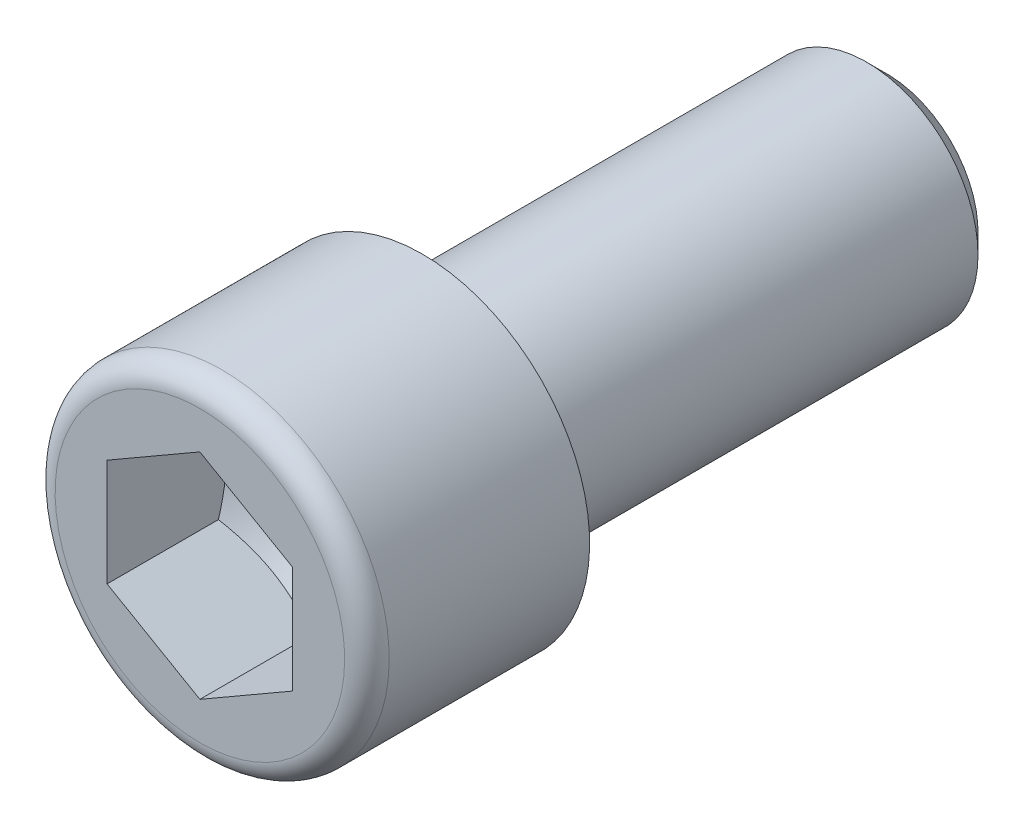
ISO-10303-21;
HEADER;
FILE_DESCRIPTION(('STEP AP214'),'2;1');
FILE_NAME('part.step','',(''),(''),'','','');
FILE_SCHEMA(('AUTOMOTIVE_DESIGN { 1 0 10303 214 1 1 1 1 }'));
ENDSEC;
DATA;
#1=APPLICATION_CONTEXT('core data for automotive mechanical design processes');
#2=APPLICATION_PROTOCOL_DEFINITION('international standard','automotive_design',2000,#1);
#3=PRODUCT_CONTEXT('',#1,'mechanical');
#4=PRODUCT('Part','Part','',(#3));
#5=PRODUCT_RELATED_PRODUCT_CATEGORY('part','',(#4));
#6=PRODUCT_DEFINITION_FORMATION('','',#4);
#7=PRODUCT_DEFINITION_CONTEXT('part definition',#1,'design');
#8=PRODUCT_DEFINITION('design','',#6,#7);
#9=PRODUCT_DEFINITION_SHAPE('','',#8);
#10=(LENGTH_UNIT() NAMED_UNIT(*) SI_UNIT(.MILLI.,.METRE.));
#11=(NAMED_UNIT(*) PLANE_ANGLE_UNIT() SI_UNIT($,.RADIAN.));
#12=(NAMED_UNIT(*) SI_UNIT($,.STERADIAN.) SOLID_ANGLE_UNIT());
#13=UNCERTAINTY_MEASURE_WITH_UNIT(LENGTH_MEASURE(1.E-05),#10,'distance_accuracy_value','');
#14=(GEOMETRIC_REPRESENTATION_CONTEXT(3) GLOBAL_UNCERTAINTY_ASSIGNED_CONTEXT((#13)) GLOBAL_UNIT_ASSIGNED_CONTEXT((#10,
#11,#12)) REPRESENTATION_CONTEXT('',''));
#15=CARTESIAN_POINT('',(0.,0.,0.));
#16=DIRECTION('',(0.,0.,1.));
#17=DIRECTION('',(1.,0.,0.));
#18=AXIS2_PLACEMENT_3D('',#15,#16,#17);
#19=CARTESIAN_POINT('',(-9.52916410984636E-12,-5.49977766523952E-12,6.01999999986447));
#20=DIRECTION('',(-1.58298229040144E-12,-9.13546995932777E-13,1.));
#21=DIRECTION('',(0.866025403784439,-0.5,9.14129379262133E-13));
#22=AXIS2_PLACEMENT_3D('',#19,#20,#21);
#23=CONICAL_SURFACE('',#22,5.80814370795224,1.04719755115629);
#24=CARTESIAN_POINT('',(-6.10645325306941E-11,-1.00891914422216E-10,2.66666666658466));
#25=VERTEX_POINT('',#24);
#26=VERTEX_LOOP('',#25);
#27=FACE_BOUND('',#26,.T.);
#28=CARTESIAN_POINT('',(4.99999999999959,2.88675134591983,5.99999999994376));
#29=CARTESIAN_POINT('',(4.78026878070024,3.01361322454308,5.92674338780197));
#30=CARTESIAN_POINT('',(4.55865818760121,3.14156016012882,5.86011395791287));
#31=CARTESIAN_POINT('',(4.1115999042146,3.39966938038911,5.74381369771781));
#32=CARTESIAN_POINT('',(3.88614427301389,3.529836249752,5.69418400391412));
#33=CARTESIAN_POINT('',(3.43799264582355,3.78857671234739,5.6169443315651));
#34=CARTESIAN_POINT('',(3.21536642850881,3.91711001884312,5.58881982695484));
#35=CARTESIAN_POINT('',(2.88064429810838,4.1103619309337,5.56360327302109));
#36=CARTESIAN_POINT('',(2.76899393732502,4.17482329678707,5.55802472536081));
#37=CARTESIAN_POINT('',(2.54559014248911,4.30380553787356,5.55261913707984));
#38=CARTESIAN_POINT('',(2.4338367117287,4.36832641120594,5.55279191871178));
#39=CARTESIAN_POINT('',(2.12768962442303,4.54508051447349,5.56117973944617));
#40=CARTESIAN_POINT('',(1.93339749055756,4.65725513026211,5.57525699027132));
#41=CARTESIAN_POINT('',(1.54610267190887,4.8808598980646,5.6198894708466));
#42=CARTESIAN_POINT('',(1.35310134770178,4.99228926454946,5.65045994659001));
#43=CARTESIAN_POINT('',(0.965026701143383,5.21634426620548,5.72687569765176));
#44=CARTESIAN_POINT('',(0.770002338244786,5.32894163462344,5.77304466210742));
#45=CARTESIAN_POINT('',(0.382861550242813,5.55245747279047,5.8778288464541));
#46=CARTESIAN_POINT('',(0.190740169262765,5.66337880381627,5.93641946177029));
#47=CARTESIAN_POINT('',(-2.6400756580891E-11,5.77350269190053,5.99999999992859));
#48=B_SPLINE_CURVE_WITH_KNOTS('',3,(#28,#29,#30,#31,#32,#33,#34,#35,#36,#37,#38,#39,#40,#41,#42,
#43,#44,#45,#46,#47),.UNSPECIFIED.,.F.,.F.,(4,2,2,2,2,2,2,2,2,4),(0.,0.792540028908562,
1.58698454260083,2.36176901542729,2.7487873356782,3.13579369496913,3.80946092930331,
4.48375195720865,5.17299552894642,5.86088640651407),.UNSPECIFIED.);
#49=CARTESIAN_POINT('',(5.,2.88675134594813,5.99999999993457));
#50=VERTEX_POINT('',#49);
#51=CARTESIAN_POINT('',(-1.8996956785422E-11,5.77350269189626,5.99999999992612));
#52=VERTEX_POINT('',#51);
#53=EDGE_CURVE('E18',#50,#52,#48,.T.);
#54=ORIENTED_EDGE('',*,*,#53,.T.);
#55=CARTESIAN_POINT('',(1.48067322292E-11,5.77350269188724,5.99999999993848));
#56=CARTESIAN_POINT('',(-0.219731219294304,5.64664081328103,5.92674338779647));
#57=CARTESIAN_POINT('',(-0.441341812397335,5.51869387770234,5.86011395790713));
#58=CARTESIAN_POINT('',(-0.888400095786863,5.26058465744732,5.7438136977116));
#59=CARTESIAN_POINT('',(-1.11385572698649,5.13041778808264,5.69418400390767));
#60=CARTESIAN_POINT('',(-1.56200735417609,4.8716773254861,5.61694433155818));
#61=CARTESIAN_POINT('',(-1.78463357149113,4.74314401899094,5.58881982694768));
#62=CARTESIAN_POINT('',(-2.11935570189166,4.54989210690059,5.56360327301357));
#63=CARTESIAN_POINT('',(-2.23100606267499,4.48543074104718,5.55802472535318));
#64=CARTESIAN_POINT('',(-2.45440985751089,4.35644849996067,5.55261913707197));
#65=CARTESIAN_POINT('',(-2.5661632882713,4.29192762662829,5.5527919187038));
#66=CARTESIAN_POINT('',(-2.87231037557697,4.11517352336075,5.56117973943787));
#67=CARTESIAN_POINT('',(-3.06660250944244,4.00299890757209,5.57525699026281));
#68=CARTESIAN_POINT('',(-3.45389732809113,3.77939413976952,5.61988947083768));
#69=CARTESIAN_POINT('',(-3.64689865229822,3.6679647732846,5.65045994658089));
#70=CARTESIAN_POINT('',(-4.03497329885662,3.44390977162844,5.72687569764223));
#71=CARTESIAN_POINT('',(-4.22999766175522,3.3313124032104,5.77304466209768));
#72=CARTESIAN_POINT('',(-4.61713844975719,3.10779656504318,5.87782884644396));
#73=CARTESIAN_POINT('',(-4.80925983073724,2.99687523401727,5.93641946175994));
#74=CARTESIAN_POINT('',(-5.0000000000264,2.88675134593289,5.99999999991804));
#75=B_SPLINE_CURVE_WITH_KNOTS('',3,(#55,#56,#57,#58,#59,#60,#61,#62,#63,#64,#65,#66,#67,#68,#69,
#70,#71,#72,#73,#74),.UNSPECIFIED.,.F.,.F.,(4,2,2,2,2,2,2,2,2,4),(0.,0.792540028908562,
1.58698454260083,2.36176901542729,2.74878733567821,3.13579369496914,3.80946092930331,
4.48375195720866,5.17299552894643,5.86088640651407),.UNSPECIFIED.);
#76=CARTESIAN_POINT('',(-5.000000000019,2.88675134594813,5.99999999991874));
#77=VERTEX_POINT('',#76);
#78=EDGE_CURVE('E79',#52,#77,#75,.T.);
#79=ORIENTED_EDGE('',*,*,#78,.T.);
#80=CARTESIAN_POINT('',(-4.99999999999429,2.88675134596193,5.99999999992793));
#81=CARTESIAN_POINT('',(-5.00000000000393,2.63302758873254,5.92674338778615));
#82=CARTESIAN_POINT('',(-5.00000000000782,2.37713371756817,5.86011395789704));
#83=CARTESIAN_POINT('',(-5.00000000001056,1.86091527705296,5.74381369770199));
#84=CARTESIAN_POINT('',(-5.0000000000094,1.60058153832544,5.69418400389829));
#85=CARTESIAN_POINT('',(-5.00000000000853,1.08310061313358,5.61694433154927));
#86=CARTESIAN_POINT('',(-5.00000000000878,0.826034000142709,5.58881982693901));
#87=CARTESIAN_POINT('',(-5.00000000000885,0.439530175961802,5.56360327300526));
#88=CARTESIAN_POINT('',(-5.00000000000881,0.310607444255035,5.55802472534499));
#89=CARTESIAN_POINT('',(-5.00000000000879,0.0526429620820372,5.55261913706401));
#90=CARTESIAN_POINT('',(-5.00000000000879,-0.0763987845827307,5.55279191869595));
#91=CARTESIAN_POINT('',(-5.00000000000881,-0.429906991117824,5.56117973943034));
#92=CARTESIAN_POINT('',(-5.00000000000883,-0.654256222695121,5.57525699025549));
#93=CARTESIAN_POINT('',(-5.0000000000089,-1.10146575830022,5.61988947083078));
#94=CARTESIAN_POINT('',(-5.00000000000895,-1.32432449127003,5.65045994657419));
#95=CARTESIAN_POINT('',(-5.00000000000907,-1.77243449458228,5.72687569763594));
#96=CARTESIAN_POINT('',(-5.00000000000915,-1.99762923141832,5.7730446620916));
#97=CARTESIAN_POINT('',(-5.00000000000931,-2.44466090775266,5.87782884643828));
#98=CARTESIAN_POINT('',(-5.0000000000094,-2.66650356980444,5.93641946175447));
#99=CARTESIAN_POINT('',(-5.0000000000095,-2.88675134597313,5.99999999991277));
#100=B_SPLINE_CURVE_WITH_KNOTS('',3,(#80,#81,#82,#83,#84,#85,#86,#87,#88,#89,#90,#91,#92,#93,
#94,#95,#96,#97,#98,#99),.UNSPECIFIED.,.F.,.F.,(4,2,2,2,2,2,2,2,2,4),(0.,0.792540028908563,
1.58698454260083,2.36176901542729,2.74878733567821,3.13579369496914,3.80946092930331,
4.48375195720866,5.17299552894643,5.86088640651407),.UNSPECIFIED.);
#101=CARTESIAN_POINT('',(-5.000000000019,-2.88675134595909,5.99999999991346));
#102=VERTEX_POINT('',#101);
#103=EDGE_CURVE('E105',#77,#102,#100,.T.);
#104=ORIENTED_EDGE('',*,*,#103,.T.);
#105=CARTESIAN_POINT('',(-5.00000000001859,-2.88675134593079,5.99999999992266));
#106=CARTESIAN_POINT('',(-4.78026878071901,-3.01361322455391,5.92674338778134));
#107=CARTESIAN_POINT('',(-4.55865818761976,-3.14156016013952,5.8601139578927));
#108=CARTESIAN_POINT('',(-4.11159990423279,-3.3996693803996,5.74381369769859));
#109=CARTESIAN_POINT('',(-3.88614427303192,-3.5298362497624,5.69418400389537));
#110=CARTESIAN_POINT('',(-3.43799264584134,-3.78857671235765,5.61694433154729));
#111=CARTESIAN_POINT('',(-3.21536642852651,-3.91711001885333,5.5888198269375));
#112=CARTESIAN_POINT('',(-2.880644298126,-4.11036193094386,5.56360327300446));
#113=CARTESIAN_POINT('',(-2.76899393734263,-4.17482329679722,5.55802472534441));
#114=CARTESIAN_POINT('',(-2.54559014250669,-4.3038055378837,5.55261913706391));
#115=CARTESIAN_POINT('',(-2.43383671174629,-4.36832641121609,5.5527919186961));
#116=CARTESIAN_POINT('',(-2.12768962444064,-4.54508051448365,5.56117973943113));
#117=CARTESIAN_POINT('',(-1.93339749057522,-4.6572551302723,5.57525699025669));
#118=CARTESIAN_POINT('',(-1.54610267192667,-4.88085989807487,5.61988947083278));
#119=CARTESIAN_POINT('',(-1.35310134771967,-4.99228926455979,5.65045994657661));
#120=CARTESIAN_POINT('',(-0.965026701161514,-5.21634426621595,5.72687569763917));
#121=CARTESIAN_POINT('',(-0.770002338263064,-5.32894163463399,5.77304466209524));
#122=CARTESIAN_POINT('',(-0.382861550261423,-5.55245747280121,5.87782884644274));
#123=CARTESIAN_POINT('',(-0.19074016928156,-5.66337880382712,5.93641946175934));
#124=CARTESIAN_POINT('',(7.40293243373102E-12,-5.7735026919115,5.99999999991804));
#125=B_SPLINE_CURVE_WITH_KNOTS('',3,(#105,#106,#107,#108,#109,#110,#111,#112,#113,#114,#115,
#116,#117,#118,#119,#120,#121,#122,#123,#124),.UNSPECIFIED.,.F.,.F.,(4,2,2,2,2,2,2,2,2,4),(0.,
0.792540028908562,1.58698454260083,2.36176901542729,2.7487873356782,3.13579369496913,
3.80946092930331,4.48375195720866,5.17299552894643,5.86088640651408),.UNSPECIFIED.);
#126=CARTESIAN_POINT('',(-9.49804471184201E-12,-5.77350269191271,5.99999999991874));
#127=VERTEX_POINT('',#126);
#128=EDGE_CURVE('E130',#102,#127,#125,.T.);
#129=ORIENTED_EDGE('',*,*,#128,.T.);
#130=CARTESIAN_POINT('',(-3.3801954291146E-11,-5.77350269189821,5.99999999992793));
#131=CARTESIAN_POINT('',(0.219731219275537,-5.64664081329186,5.92674338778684));
#132=CARTESIAN_POINT('',(0.441341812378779,-5.51869387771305,5.86011395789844));
#133=CARTESIAN_POINT('',(0.888400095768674,-5.26058465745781,5.7438136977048));
#134=CARTESIAN_POINT('',(1.11385572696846,-5.13041778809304,5.69418400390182));
#135=CARTESIAN_POINT('',(1.5620073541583,-4.87167732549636,5.61694433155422));
#136=CARTESIAN_POINT('',(1.78463357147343,-4.74314401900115,5.58881982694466));
#137=CARTESIAN_POINT('',(2.11935570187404,-4.54989210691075,5.56360327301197));
#138=CARTESIAN_POINT('',(2.23100606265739,-4.48543074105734,5.55802472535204));
#139=CARTESIAN_POINT('',(2.45440985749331,-4.35644849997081,5.55261913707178));
#140=CARTESIAN_POINT('',(2.56616328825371,-4.29192762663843,5.55279191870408));
#141=CARTESIAN_POINT('',(2.87231037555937,-4.11517352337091,5.56117973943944));
#142=CARTESIAN_POINT('',(3.06660250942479,-4.00299890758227,5.5752569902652));
#143=CARTESIAN_POINT('',(3.45389732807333,-3.77939413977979,5.61988947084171));
#144=CARTESIAN_POINT('',(3.64689865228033,-3.66796477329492,5.65045994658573));
#145=CARTESIAN_POINT('',(4.03497329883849,-3.4439097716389,5.72687569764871));
#146=CARTESIAN_POINT('',(4.22999766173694,-3.33131240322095,5.77304466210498));
#147=CARTESIAN_POINT('',(4.61713844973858,-3.10779656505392,5.87782884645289));
#148=CARTESIAN_POINT('',(4.80925983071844,-2.99687523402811,5.93641946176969));
#149=CARTESIAN_POINT('',(5.0000000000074,-2.88675134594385,5.99999999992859));
#150=B_SPLINE_CURVE_WITH_KNOTS('',3,(#130,#131,#132,#133,#134,#135,#136,#137,#138,#139,#140,
#141,#142,#143,#144,#145,#146,#147,#148,#149),.UNSPECIFIED.,.F.,.F.,(4,2,2,2,2,2,2,2,2,4),(0.,
0.792540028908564,1.58698454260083,2.36176901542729,2.74878733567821,3.13579369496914,
3.80946092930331,4.48375195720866,5.17299552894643,5.86088640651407),.UNSPECIFIED.);
#151=CARTESIAN_POINT('',(5.,-2.88675134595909,5.99999999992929));
#152=VERTEX_POINT('',#151);
#153=EDGE_CURVE('E139',#127,#152,#150,.T.);
#154=ORIENTED_EDGE('',*,*,#153,.T.);
#155=CARTESIAN_POINT('',(4.99999999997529,-2.88675134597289,5.99999999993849));
#156=CARTESIAN_POINT('',(4.99999999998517,-2.63302758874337,5.92674338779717));
#157=CARTESIAN_POINT('',(4.99999999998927,-2.37713371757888,5.86011395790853));
#158=CARTESIAN_POINT('',(4.99999999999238,-1.86091527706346,5.74381369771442));
#159=CARTESIAN_POINT('',(4.99999999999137,-1.60058153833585,5.6941840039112));
#160=CARTESIAN_POINT('',(4.99999999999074,-1.08310061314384,5.61694433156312));
#161=CARTESIAN_POINT('',(4.99999999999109,-0.826034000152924,5.58881982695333));
#162=CARTESIAN_POINT('',(4.99999999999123,-0.43953017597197,5.56360327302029));
#163=CARTESIAN_POINT('',(4.99999999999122,-0.310607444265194,5.55802472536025));
#164=CARTESIAN_POINT('',(4.99999999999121,-0.0526429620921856,5.55261913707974));
#165=CARTESIAN_POINT('',(4.99999999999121,0.0763987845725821,5.55279191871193));
#166=CARTESIAN_POINT('',(4.99999999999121,0.429906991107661,5.56117973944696));
#167=CARTESIAN_POINT('',(4.99999999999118,0.654256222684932,5.57525699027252));
#168=CARTESIAN_POINT('',(4.99999999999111,1.10146575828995,5.61988947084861));
#169=CARTESIAN_POINT('',(4.99999999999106,1.3243244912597,5.65045994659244));
#170=CARTESIAN_POINT('',(4.99999999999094,1.77243449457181,5.72687569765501));
#171=CARTESIAN_POINT('',(4.99999999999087,1.99762923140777,5.77304466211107));
#172=CARTESIAN_POINT('',(4.9999999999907,2.44466090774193,5.87782884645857));
#173=CARTESIAN_POINT('',(4.9999999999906,2.66650356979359,5.93641946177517));
#174=CARTESIAN_POINT('',(4.9999999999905,2.88675134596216,5.99999999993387));
#175=B_SPLINE_CURVE_WITH_KNOTS('',3,(#155,#156,#157,#158,#159,#160,#161,#162,#163,#164,#165,
#166,#167,#168,#169,#170,#171,#172,#173,#174),.UNSPECIFIED.,.F.,.F.,(4,2,2,2,2,2,2,2,2,4),(0.,
0.792540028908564,1.58698454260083,2.36176901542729,2.74878733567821,3.13579369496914,
3.80946092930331,4.48375195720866,5.17299552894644,5.86088640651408),.UNSPECIFIED.);
#176=EDGE_CURVE('E81',#152,#50,#175,.T.);
#177=ORIENTED_EDGE('',*,*,#176,.T.);
#178=EDGE_LOOP('',(#54,#79,#104,#129,#154,#177));
#179=FACE_BOUND('',#178,.T.);
#180=ADVANCED_FACE('F14',(#27,#179),#23,.F.);
#181=CARTESIAN_POINT('',(4.999999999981,2.88675134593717,12.0000000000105));
#182=DIRECTION('',(0.5,0.866025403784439,1.58264538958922E-12));
#183=DIRECTION('',(0.866025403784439,-0.5,9.14054711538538E-13));
#184=AXIS2_PLACEMENT_3D('',#181,#182,#183);
#185=PLANE('',#184);
#186=DIRECTION('',(1.58291729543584E-12,9.13584329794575E-13,-1.));
#187=VECTOR('',#186,1.);
#188=CARTESIAN_POINT('',(4.99999999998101,2.88675134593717,12.0000000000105));
#189=LINE('',#188,#187);
#190=CARTESIAN_POINT('',(4.999999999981,2.88675134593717,12.0000000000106));
#191=VERTEX_POINT('',#190);
#192=EDGE_CURVE('E83',#50,#191,#189,.F.);
#193=ORIENTED_EDGE('',*,*,#192,.T.);
#194=DIRECTION('',(0.866025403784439,-0.5,9.14054711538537E-13));
#195=VECTOR('',#194,1.);
#196=CARTESIAN_POINT('',(2.49999999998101,4.33012701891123,12.0000000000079));
#197=LINE('',#196,#195);
#198=CARTESIAN_POINT('',(-1.89947883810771E-11,5.7735026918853,12.0000000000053));
#199=VERTEX_POINT('',#198);
#200=EDGE_CURVE('E88',#199,#191,#197,.T.);
#201=ORIENTED_EDGE('',*,*,#200,.F.);
#202=DIRECTION('',(1.58291779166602E-12,9.13584043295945E-13,-1.));
#203=VECTOR('',#202,1.);
#204=CARTESIAN_POINT('',(-1.89947883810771E-11,5.7735026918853,12.0000000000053));
#205=LINE('',#204,#203);
#206=EDGE_CURVE('E86',#199,#52,#205,.T.);
#207=ORIENTED_EDGE('',*,*,#206,.T.);
#208=ORIENTED_EDGE('',*,*,#53,.F.);
#209=EDGE_LOOP('',(#193,#201,#207,#208));
#210=FACE_BOUND('',#209,.T.);
#211=ADVANCED_FACE('F75',(#210),#185,.F.);
#212=CARTESIAN_POINT('',(4.99999999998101,-2.88675134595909,12.0000000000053));
#213=DIRECTION('',(1.,0.,1.58291729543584E-12));
#214=DIRECTION('',(0.,-1.,-9.13584329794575E-13));
#215=AXIS2_PLACEMENT_3D('',#212,#213,#214);
#216=PLANE('',#215);
#217=DIRECTION('',(1.58291779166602E-12,9.13584043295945E-13,-1.));
#218=VECTOR('',#217,1.);
#219=CARTESIAN_POINT('',(4.99999999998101,-2.88675134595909,12.0000000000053));
#220=LINE('',#219,#218);
#221=CARTESIAN_POINT('',(4.99999999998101,-2.88675134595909,12.0000000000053));
#222=VERTEX_POINT('',#221);
#223=EDGE_CURVE('E144',#152,#222,#220,.F.);
#224=ORIENTED_EDGE('',*,*,#223,.T.);
#225=DIRECTION('',(0.,-1.,-9.13584329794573E-13));
#226=VECTOR('',#225,1.);
#227=CARTESIAN_POINT('',(4.999999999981,2.88675134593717,12.0000000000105));
#228=LINE('',#227,#226);
#229=EDGE_CURVE('E94',#191,#222,#228,.T.);
#230=ORIENTED_EDGE('',*,*,#229,.F.);
#231=ORIENTED_EDGE('',*,*,#192,.F.);
#232=ORIENTED_EDGE('',*,*,#176,.F.);
#233=EDGE_LOOP('',(#224,#230,#231,#232));
#234=FACE_BOUND('',#233,.T.);
#235=ADVANCED_FACE('F149',(#234),#216,.F.);
#236=CARTESIAN_POINT('',(-1.89956557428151E-11,-5.77350269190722,11.9999999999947));
#237=DIRECTION('',(0.5,-0.866025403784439,0.));
#238=DIRECTION('',(-0.866025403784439,-0.5,-1.82763904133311E-12));
#239=AXIS2_PLACEMENT_3D('',#236,#237,#238);
#240=PLANE('',#239);
#241=DIRECTION('',(1.58291729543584E-12,9.13583756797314E-13,-1.));
#242=VECTOR('',#241,1.);
#243=CARTESIAN_POINT('',(-1.89952220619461E-11,-5.77350269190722,11.9999999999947));
#244=LINE('',#243,#242);
#245=CARTESIAN_POINT('',(-1.89952220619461E-11,-5.77350269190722,11.9999999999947));
#246=VERTEX_POINT('',#245);
#247=EDGE_CURVE('E138',#127,#246,#244,.F.);
#248=ORIENTED_EDGE('',*,*,#247,.T.);
#249=DIRECTION('',(-0.866025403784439,-0.5,-1.82763904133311E-12));
#250=VECTOR('',#249,1.);
#251=CARTESIAN_POINT('',(4.99999999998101,-2.88675134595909,12.0000000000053));
#252=LINE('',#251,#250);
#253=EDGE_CURVE('E268',#222,#246,#252,.T.);
#254=ORIENTED_EDGE('',*,*,#253,.F.);
#255=ORIENTED_EDGE('',*,*,#223,.F.);
#256=ORIENTED_EDGE('',*,*,#153,.F.);
#257=EDGE_LOOP('',(#248,#254,#255,#256));
#258=FACE_BOUND('',#257,.T.);
#259=ADVANCED_FACE('F126',(#258),#240,.F.);
#260=CARTESIAN_POINT('',(-5.000000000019,-2.88675134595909,11.9999999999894));
#261=DIRECTION('',(-0.5,-0.866025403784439,-1.58264538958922E-12));
#262=DIRECTION('',(-0.866025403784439,0.5,-9.14054711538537E-13));
#263=AXIS2_PLACEMENT_3D('',#260,#261,#262);
#264=PLANE('',#263);
#265=DIRECTION('',(1.58291729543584E-12,9.13584329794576E-13,-1.));
#266=VECTOR('',#265,1.);
#267=CARTESIAN_POINT('',(-5.000000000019,-2.88675134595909,11.9999999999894));
#268=LINE('',#267,#266);
#269=CARTESIAN_POINT('',(-5.000000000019,-2.88675134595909,11.9999999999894));
#270=VERTEX_POINT('',#269);
#271=EDGE_CURVE('E137',#102,#270,#268,.F.);
#272=ORIENTED_EDGE('',*,*,#271,.T.);
#273=DIRECTION('',(0.866025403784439,-0.5,9.14054711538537E-13));
#274=VECTOR('',#273,1.);
#275=CARTESIAN_POINT('',(-2.500000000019,-4.33012701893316,11.9999999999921));
#276=LINE('',#275,#274);
#277=EDGE_CURVE('E263',#246,#270,#276,.F.);
#278=ORIENTED_EDGE('',*,*,#277,.F.);
#279=ORIENTED_EDGE('',*,*,#247,.F.);
#280=ORIENTED_EDGE('',*,*,#128,.F.);
#281=EDGE_LOOP('',(#272,#278,#279,#280));
#282=FACE_BOUND('',#281,.T.);
#283=ADVANCED_FACE('F122',(#282),#264,.F.);
#284=CARTESIAN_POINT('',(-5.000000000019,2.88675134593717,11.9999999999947));
#285=DIRECTION('',(-1.,0.,-1.58291729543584E-12));
#286=DIRECTION('',(0.,1.,9.13584329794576E-13));
#287=AXIS2_PLACEMENT_3D('',#284,#285,#286);
#288=PLANE('',#287);
#289=DIRECTION('',(1.58291779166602E-12,9.13584043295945E-13,-1.));
#290=VECTOR('',#289,1.);
#291=CARTESIAN_POINT('',(-5.000000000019,2.88675134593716,11.9999999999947));
#292=LINE('',#291,#290);
#293=CARTESIAN_POINT('',(-5.000000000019,2.88675134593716,11.9999999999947));
#294=VERTEX_POINT('',#293);
#295=EDGE_CURVE('E37',#77,#294,#292,.F.);
#296=ORIENTED_EDGE('',*,*,#295,.T.);
#297=DIRECTION('',(0.,1.,9.13584329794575E-13));
#298=VECTOR('',#297,1.);
#299=CARTESIAN_POINT('',(-5.000000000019,-2.88675134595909,11.9999999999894));
#300=LINE('',#299,#298);
#301=EDGE_CURVE('E258',#270,#294,#300,.T.);
#302=ORIENTED_EDGE('',*,*,#301,.F.);
#303=ORIENTED_EDGE('',*,*,#271,.F.);
#304=ORIENTED_EDGE('',*,*,#103,.F.);
#305=EDGE_LOOP('',(#296,#302,#303,#304));
#306=FACE_BOUND('',#305,.T.);
#307=ADVANCED_FACE('F116',(#306),#288,.F.);
#308=CARTESIAN_POINT('',(-1.89947883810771E-11,5.7735026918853,12.0000000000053));
#309=DIRECTION('',(-0.5,0.866025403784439,0.));
#310=DIRECTION('',(0.866025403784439,0.5,1.82763904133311E-12));
#311=AXIS2_PLACEMENT_3D('',#308,#309,#310);
#312=PLANE('',#311);
#313=ORIENTED_EDGE('',*,*,#206,.F.);
#314=DIRECTION('',(0.866025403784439,0.5,1.82763904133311E-12));
#315=VECTOR('',#314,1.);
#316=CARTESIAN_POINT('',(-5.000000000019,2.88675134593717,11.9999999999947));
#317=LINE('',#316,#315);
#318=EDGE_CURVE('E256',#294,#199,#317,.T.);
#319=ORIENTED_EDGE('',*,*,#318,.F.);
#320=ORIENTED_EDGE('',*,*,#295,.F.);
#321=ORIENTED_EDGE('',*,*,#78,.F.);
#322=EDGE_LOOP('',(#313,#319,#320,#321));
#323=FACE_BOUND('',#322,.T.);
#324=ADVANCED_FACE('F92',(#323),#312,.F.);
#325=CARTESIAN_POINT('',(3.69337567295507,6.39711431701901,12.0000000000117));
#326=DIRECTION('',(-1.58291729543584E-12,-9.13583756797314E-13,1.));
#327=DIRECTION('',(-0.5,-0.866025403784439,-1.58264538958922E-12));
#328=AXIS2_PLACEMENT_3D('',#325,#326,#327);
#329=PLANE('',#328);
#330=ORIENTED_EDGE('',*,*,#301,.T.);
#331=ORIENTED_EDGE('',*,*,#318,.T.);
#332=ORIENTED_EDGE('',*,*,#200,.T.);
#333=ORIENTED_EDGE('',*,*,#229,.T.);
#334=ORIENTED_EDGE('',*,*,#253,.T.);
#335=ORIENTED_EDGE('',*,*,#277,.T.);
#336=EDGE_LOOP('',(#330,#331,#332,#333,#334,#335));
#337=FACE_BOUND('',#336,.T.);
#338=CARTESIAN_POINT('',(-1.8994999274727E-11,-1.09629907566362E-11,12.));
#339=DIRECTION('',(1.58291729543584E-12,9.13583756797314E-13,-1.));
#340=DIRECTION('',(0.499999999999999,0.866025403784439,1.58260157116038E-12));
#341=AXIS2_PLACEMENT_3D('',#338,#339,#340);
#342=CIRCLE('',#341,7.80000000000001);
#343=CARTESIAN_POINT('',(3.899999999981,6.75499814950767,12.0000000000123));
#344=VERTEX_POINT('',#343);
#345=EDGE_CURVE('E219',#344,#344,#342,.T.);
#346=ORIENTED_EDGE('',*,*,#345,.F.);
#347=EDGE_LOOP('',(#346));
#348=FACE_BOUND('',#347,.T.);
#349=ADVANCED_FACE('F115',(#337,#348),#329,.T.);
#350=CARTESIAN_POINT('',(-1.7095498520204E-11,-9.86669024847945E-12,10.8));
#351=DIRECTION('',(1.58291729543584E-12,9.13583756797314E-13,-1.));
#352=DIRECTION('',(-0.866025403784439,0.5,-9.14054711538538E-13));
#353=AXIS2_PLACEMENT_3D('',#350,#351,#352);
#354=TOROIDAL_SURFACE('',#353,7.8,1.2);
#355=CARTESIAN_POINT('',(-1.7095498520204E-11,-9.86669024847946E-12,10.8));
#356=DIRECTION('',(1.58291729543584E-12,9.13583756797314E-13,-1.));
#357=DIRECTION('',(0.5,0.866025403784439,1.58264538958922E-12));
#358=AXIS2_PLACEMENT_3D('',#355,#356,#357);
#359=CIRCLE('',#358,9.);
#360=CARTESIAN_POINT('',(4.4999999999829,7.79422863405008,10.8000000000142));
#361=VERTEX_POINT('',#360);
#362=EDGE_CURVE('E283',#361,#361,#359,.T.);
#363=ORIENTED_EDGE('',*,*,#362,.F.);
#364=EDGE_LOOP('',(#363));
#365=FACE_BOUND('',#364,.T.);
#366=ORIENTED_EDGE('',*,*,#345,.T.);
#367=EDGE_LOOP('',(#366));
#368=FACE_BOUND('',#367,.T.);
#369=ADVANCED_FACE('F203',(#365,#368),#354,.T.);
#370=CARTESIAN_POINT('',(-9.49749550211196E-12,-5.48148821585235E-12,6.));
#371=DIRECTION('',(1.58291729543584E-12,9.13583756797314E-13,-1.));
#372=DIRECTION('',(0.5,0.866025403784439,1.58264538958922E-12));
#373=AXIS2_PLACEMENT_3D('',#370,#371,#372);
#374=CYLINDRICAL_SURFACE('',#373,9.);
#375=ORIENTED_EDGE('',*,*,#362,.T.);
#376=EDGE_LOOP('',(#375));
#377=FACE_BOUND('',#376,.T.);
#378=CARTESIAN_POINT('',(0.,0.,0.));
#379=DIRECTION('',(1.58291729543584E-12,9.13583756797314E-13,-1.));
#380=DIRECTION('',(0.5,0.866025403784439,1.58264538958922E-12));
#381=AXIS2_PLACEMENT_3D('',#378,#379,#380);
#382=CIRCLE('',#381,9.);
#383=CARTESIAN_POINT('',(4.5,7.79422863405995,1.4241206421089E-11));
#384=VERTEX_POINT('',#383);
#385=EDGE_CURVE('E103',#384,#384,#382,.T.);
#386=ORIENTED_EDGE('',*,*,#385,.F.);
#387=EDGE_LOOP('',(#386));
#388=FACE_BOUND('',#387,.T.);
#389=ADVANCED_FACE('F200',(#377,#388),#374,.T.);
#390=CARTESIAN_POINT('',(1.50000000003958,2.59807621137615,-24.9999999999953));
#391=DIRECTION('',(1.58291729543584E-12,9.13583756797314E-13,-1.));
#392=DIRECTION('',(0.5,0.866025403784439,1.58264538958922E-12));
#393=AXIS2_PLACEMENT_3D('',#390,#391,#392);
#394=PLANE('',#393);
#395=CARTESIAN_POINT('',(3.95732094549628E-11,2.28394530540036E-11,-25.0000000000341));
#396=DIRECTION('',(-1.58316801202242E-12,-9.13439769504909E-13,1.));
#397=DIRECTION('',(0.866025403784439,-0.5,9.1434383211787E-13));
#398=AXIS2_PLACEMENT_3D('',#395,#396,#397);
#399=CIRCLE('',#398,4.92646249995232);
#400=CARTESIAN_POINT('',(4.26644167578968,-2.46323124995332,-25.0000000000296));
#401=VERTEX_POINT('',#400);
#402=EDGE_CURVE('E278',#401,#401,#399,.T.);
#403=ORIENTED_EDGE('',*,*,#402,.F.);
#404=EDGE_LOOP('',(#403));
#405=FACE_BOUND('',#404,.T.);
#406=ADVANCED_FACE('F197',(#405),#394,.T.);
#407=CARTESIAN_POINT('',(3.75,6.49519052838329,1.18676249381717E-11));
#408=DIRECTION('',(1.58291729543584E-12,9.13583756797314E-13,-1.));
#409=DIRECTION('',(0.5,0.866025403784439,1.58264538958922E-12));
#410=AXIS2_PLACEMENT_3D('',#407,#408,#409);
#411=PLANE('',#410);
#412=CARTESIAN_POINT('',(0.,0.,0.));
#413=DIRECTION('',(1.58291729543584E-12,9.13583756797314E-13,-1.));
#414=DIRECTION('',(0.499999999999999,0.86602540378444,1.58264538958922E-12));
#415=AXIS2_PLACEMENT_3D('',#412,#413,#414);
#416=CIRCLE('',#415,6.60000000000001);
#417=CARTESIAN_POINT('',(3.29999999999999,5.71576766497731,1.04424238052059E-11));
#418=VERTEX_POINT('',#417);
#419=EDGE_CURVE('E184',#418,#418,#416,.F.);
#420=ORIENTED_EDGE('',*,*,#419,.T.);
#421=EDGE_LOOP('',(#420));
#422=FACE_BOUND('',#421,.T.);
#423=ORIENTED_EDGE('',*,*,#385,.T.);
#424=EDGE_LOOP('',(#423));
#425=FACE_BOUND('',#424,.T.);
#426=ADVANCED_FACE('F188',(#422,#425),#411,.T.);
#427=CARTESIAN_POINT('',(3.78736192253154E-11,2.18588412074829E-11,-23.9264625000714));
#428=DIRECTION('',(-1.58316801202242E-12,-9.13439769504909E-13,1.));
#429=DIRECTION('',(0.866025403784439,-0.5,9.1434383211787E-13));
#430=AXIS2_PLACEMENT_3D('',#427,#428,#429);
#431=CONICAL_SURFACE('',#430,5.99999999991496,0.785398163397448);
#432=ORIENTED_EDGE('',*,*,#402,.T.);
#433=EDGE_LOOP('',(#432));
#434=FACE_BOUND('',#433,.T.);
#435=CARTESIAN_POINT('',(3.78736195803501E-11,2.18588418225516E-11,-23.9264625));
#436=DIRECTION('',(1.58291729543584E-12,9.13583756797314E-13,-1.));
#437=DIRECTION('',(0.5,0.866025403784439,1.58264538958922E-12));
#438=AXIS2_PLACEMENT_3D('',#435,#436,#437);
#439=CIRCLE('',#438,6.);
#440=CARTESIAN_POINT('',(3.00000000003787,5.19615242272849,-23.9264624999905));
#441=VERTEX_POINT('',#440);
#442=EDGE_CURVE('E28',#441,#441,#439,.F.);
#443=ORIENTED_EDGE('',*,*,#442,.F.);
#444=EDGE_LOOP('',(#443));
#445=FACE_BOUND('',#444,.T.);
#446=ADVANCED_FACE('F166',(#434,#445),#431,.T.);
#447=CARTESIAN_POINT('',(9.4975864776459E-13,5.48164579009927E-13,-0.600000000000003));
#448=DIRECTION('',(1.58291729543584E-12,9.13583756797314E-13,-1.));
#449=DIRECTION('',(-0.866025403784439,0.5,-9.14054711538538E-13));
#450=AXIS2_PLACEMENT_3D('',#447,#448,#449);
#451=TOROIDAL_SURFACE('',#450,6.6,0.6);
#452=CARTESIAN_POINT('',(9.49758647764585E-13,5.48164579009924E-13,-0.6));
#453=DIRECTION('',(1.58291729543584E-12,9.13583756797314E-13,-1.));
#454=DIRECTION('',(0.5,0.866025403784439,1.58264538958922E-12));
#455=AXIS2_PLACEMENT_3D('',#452,#453,#454);
#456=CIRCLE('',#455,6.);
#457=CARTESIAN_POINT('',(3.00000000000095,5.19615242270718,-0.599999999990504));
#458=VERTEX_POINT('',#457);
#459=EDGE_CURVE('E9',#458,#458,#456,.T.);
#460=ORIENTED_EDGE('',*,*,#459,.F.);
#461=EDGE_LOOP('',(#460));
#462=FACE_BOUND('',#461,.T.);
#463=ORIENTED_EDGE('',*,*,#419,.F.);
#464=EDGE_LOOP('',(#463));
#465=FACE_BOUND('',#464,.T.);
#466=ADVANCED_FACE('F160',(#462,#465),#451,.F.);
#467=CARTESIAN_POINT('',(2.3249106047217E-11,1.34182757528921E-11,-14.6875));
#468=DIRECTION('',(1.58291729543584E-12,9.13583756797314E-13,-1.));
#469=DIRECTION('',(0.5,0.866025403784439,1.58264538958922E-12));
#470=AXIS2_PLACEMENT_3D('',#467,#468,#469);
#471=CYLINDRICAL_SURFACE('',#470,6.);
#472=ORIENTED_EDGE('',*,*,#459,.T.);
#473=EDGE_LOOP('',(#472));
#474=FACE_BOUND('',#473,.T.);
#475=ORIENTED_EDGE('',*,*,#442,.T.);
#476=EDGE_LOOP('',(#475));
#477=FACE_BOUND('',#476,.T.);
#478=ADVANCED_FACE('F158',(#474,#477),#471,.T.);
#479=CLOSED_SHELL('',(#180,#211,#235,#259,#283,#307,#324,#349,#369,#389,#406,#426,#446,#466,#478));
#480=MANIFOLD_SOLID_BREP('B1',#479);
#481=ADVANCED_BREP_SHAPE_REPRESENTATION('',(#18,#480),#14);
#482=SHAPE_DEFINITION_REPRESENTATION(#9,#481);
ENDSEC;
END-ISO-10303-21;
